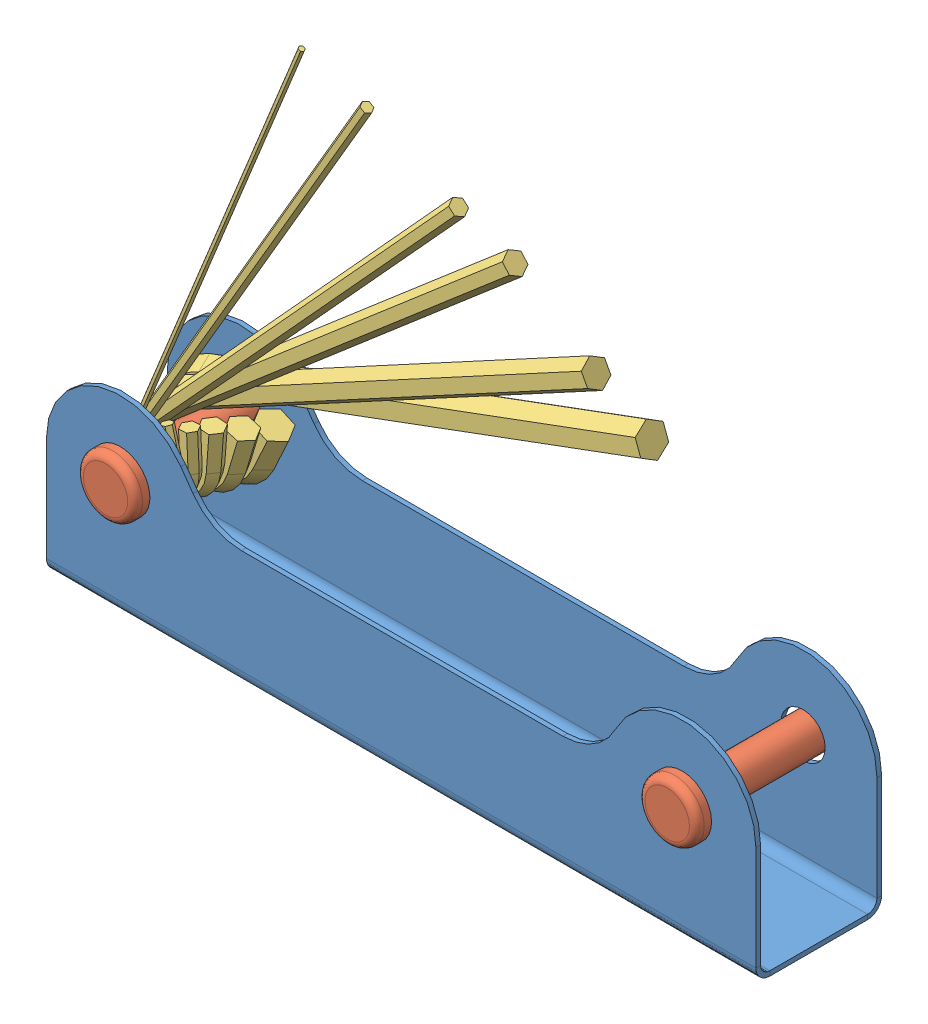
SolidWorks assembly part configs.SLDASM, configuration Default (file format 3100). Lengths in mm.
Overall size (152.4 119.96 38.17).
10 component instances, 4 part files, 21 mates.
Components (placement in the parent):
- Base Sheet Metal-1: Base Sheet Metal.SLDPRT [Default] at origin size (152.4 41.27 27)
- Pin-1: Pin.SLDPRT [Default] at (0 0 13.5) size (12.7 12.7 38.17)
- Pin-2: Pin.SLDPRT [Default] at (120.65 0 13.5) x (-0.979827 0.199848 0) z (0 0 1) size (12.7 12.7 38.17)
- Allen Wrench-1: Allen Wrench.SLDPRT [Size06] at (0 0 -9.5) x (0.937843 0.34706 0) z (0 0 1) size (110.93 21.86 6)
- Allen Wrench-2: Allen Wrench.SLDPRT [Size05] at (0 0 -4) x (0.879742 0.475451 0) z (0 0 1) size (109.77 19.55 5)
- Allen Wrench-3: Allen Wrench.SLDPRT [Size04] at (0 0 0.5) x (0.759177 0.650884 0) z (0 0 1) size (108.62 17.24 4)
- Allen Wrench-4: Allen Wrench.SLDPRT [Size03] at (0 0 4) x (0.674051 0.738685 0) z (0 0 1) size (107.46 14.93 3)
- Washer-1: Washer.SLDPRT [Default] at (0 0 10.5) size (25 25 2)
- Allen Wrench-5: Allen Wrench.SLDPRT [Size02] at (0 0 6.5) x (0.504304 0.863526 0) z (0 0 1) size (106.31 12.62 2)
- Allen Wrench-6: Allen Wrench.SLDPRT [Size01] at (0 0 8) x (0.377018 0.926206 0) z (0 0 1) size (105.15 10.31 1)
Mates (geometry in assembly coordinates):
- Coincident1: coincident aligned: plane of Base Sheet Metal-1; plane of assembly
- Coincident2: coincident aligned: plane of Base Sheet Metal-1; plane of assembly
- Coincident3: coincident aligned: plane of Base Sheet Metal-1; plane of assembly
- Coincident4: coincident aligned: axis of Base Sheet Metal-1; axis of Pin-1
- Coincident5: coincident anti-aligned: plane of Base Sheet Metal-1; plane of Pin-1
- Coincident6: coincident anti-aligned: axis of Base Sheet Metal-1; axis of Pin-2
- Coincident7: coincident anti-aligned: plane of Base Sheet Metal-1; plane of Pin-2
- Coincident8: coincident anti-aligned: axis of Pin-1; axis of Allen Wrench-1
- Coincident9: coincident anti-aligned: plane of Base Sheet Metal-1; plane of Allen Wrench-1
- Coincident10: coincident aligned: line of Allen Wrench-1; line of Allen Wrench-2
- Coincident11: coincident anti-aligned: plane of Allen Wrench-1; plane of Allen Wrench-2
- Coincident12: coincident aligned: line of Allen Wrench-2; line of Allen Wrench-3
- Coincident13: coincident anti-aligned: plane of Allen Wrench-2; plane of Allen Wrench-3
- Coincident14: coincident anti-aligned: plane of Allen Wrench-3; plane of Allen Wrench-4
- Coincident15: coincident aligned: line of Allen Wrench-2; line of Allen Wrench-4
- Coincident16: coincident aligned: line of Allen Wrench-4; axis of Washer-1
- Coincident17: coincident anti-aligned: plane of Base Sheet Metal-1; plane of Washer-1
- Coincident18: coincident aligned: line of Allen Wrench-3; line of Allen Wrench-5
- Coincident19: coincident anti-aligned: plane of Allen Wrench-4; plane of Allen Wrench-5
- Coincident20: coincident aligned: line of Allen Wrench-4; line of Allen Wrench-6
- Coincident21: coincident anti-aligned: plane of Allen Wrench-5; plane of Allen Wrench-6
